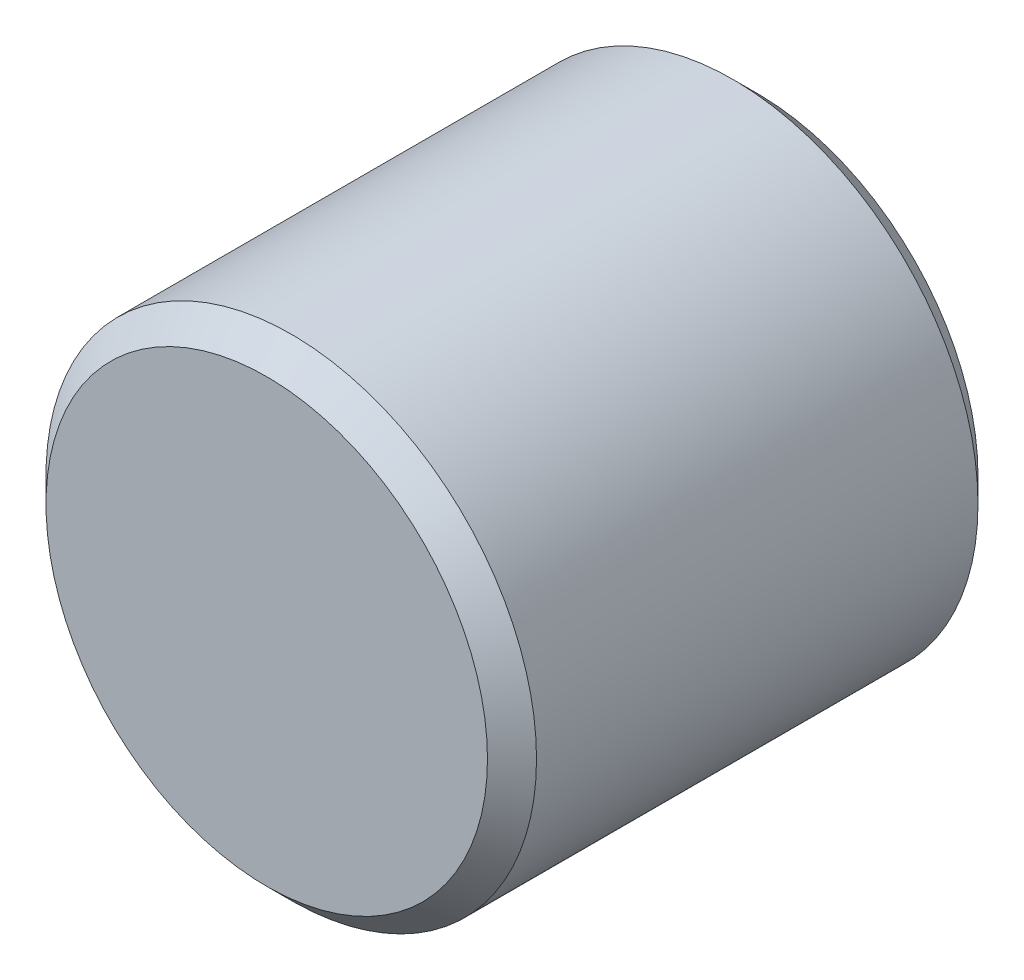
from build123d import *

# Parameters (mm, degrees)
SKETCH1_R      = 25.4
EXTRUDE1_DEPTH = 50.8
CHAMFER1_SIZE  = 2.54


with BuildPart() as part:
    # Sketch1 → Extrude1 (new body)
    with BuildSketch(Plane.XY):
        Circle(SKETCH1_R)
    extrude(amount=EXTRUDE1_DEPTH)

    # Chamfer1
    chamfer1_edges = [part.edges().sort_by_distance(p)[0] for p in [
        (-25.4, 0, 0),
        (-25.4, 0, 50.8),
    ]]
    chamfer(chamfer1_edges, length=CHAMFER1_SIZE)


solid = part.part
